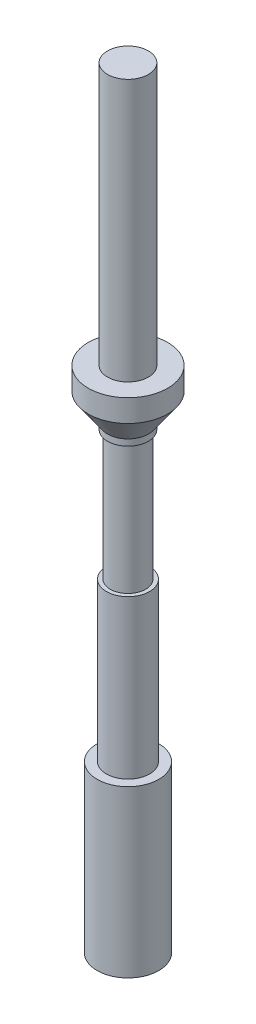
ISO-10303-21;
HEADER;
FILE_DESCRIPTION(('STEP AP214'),'2;1');
FILE_NAME('part.step','',(''),(''),'','','');
FILE_SCHEMA(('AUTOMOTIVE_DESIGN { 1 0 10303 214 1 1 1 1 }'));
ENDSEC;
DATA;
#1=APPLICATION_CONTEXT('core data for automotive mechanical design processes');
#2=APPLICATION_PROTOCOL_DEFINITION('international standard','automotive_design',2000,#1);
#3=PRODUCT_CONTEXT('',#1,'mechanical');
#4=PRODUCT('Part','Part','',(#3));
#5=PRODUCT_RELATED_PRODUCT_CATEGORY('part','',(#4));
#6=PRODUCT_DEFINITION_FORMATION('','',#4);
#7=PRODUCT_DEFINITION_CONTEXT('part definition',#1,'design');
#8=PRODUCT_DEFINITION('design','',#6,#7);
#9=PRODUCT_DEFINITION_SHAPE('','',#8);
#10=(LENGTH_UNIT() NAMED_UNIT(*) SI_UNIT(.MILLI.,.METRE.));
#11=(NAMED_UNIT(*) PLANE_ANGLE_UNIT() SI_UNIT($,.RADIAN.));
#12=(NAMED_UNIT(*) SI_UNIT($,.STERADIAN.) SOLID_ANGLE_UNIT());
#13=UNCERTAINTY_MEASURE_WITH_UNIT(LENGTH_MEASURE(1.E-05),#10,'distance_accuracy_value','');
#14=(GEOMETRIC_REPRESENTATION_CONTEXT(3) GLOBAL_UNCERTAINTY_ASSIGNED_CONTEXT((#13)) GLOBAL_UNIT_ASSIGNED_CONTEXT((#10,
#11,#12)) REPRESENTATION_CONTEXT('',''));
#15=CARTESIAN_POINT('',(0.,0.,0.));
#16=DIRECTION('',(0.,0.,1.));
#17=DIRECTION('',(1.,0.,0.));
#18=AXIS2_PLACEMENT_3D('',#15,#16,#17);
#19=CARTESIAN_POINT('',(0.,0.,0.));
#20=DIRECTION('',(0.,-1.,0.));
#21=DIRECTION('',(1.,0.,0.));
#22=AXIS2_PLACEMENT_3D('',#19,#20,#21);
#23=PLANE('',#22);
#24=CARTESIAN_POINT('',(0.,0.,0.));
#25=DIRECTION('',(0.,1.,0.));
#26=DIRECTION('',(-1.,0.,0.));
#27=AXIS2_PLACEMENT_3D('',#24,#25,#26);
#28=CIRCLE('',#27,2.65);
#29=CARTESIAN_POINT('',(-2.65,0.,0.));
#30=VERTEX_POINT('',#29);
#31=EDGE_CURVE('E10',#30,#30,#28,.T.);
#32=ORIENTED_EDGE('',*,*,#31,.T.);
#33=EDGE_LOOP('',(#32));
#34=FACE_BOUND('',#33,.T.);
#35=ADVANCED_FACE('F32',(#34),#23,.F.);
#36=CARTESIAN_POINT('',(0.,0.,0.));
#37=DIRECTION('',(0.,1.,0.));
#38=DIRECTION('',(-1.,0.,0.));
#39=AXIS2_PLACEMENT_3D('',#36,#37,#38);
#40=CYLINDRICAL_SURFACE('',#39,2.65);
#41=ORIENTED_EDGE('',*,*,#31,.F.);
#42=EDGE_LOOP('',(#41));
#43=FACE_BOUND('',#42,.T.);
#44=CARTESIAN_POINT('',(0.,-34.,0.));
#45=DIRECTION('',(0.,1.,0.));
#46=DIRECTION('',(-1.,0.,0.));
#47=AXIS2_PLACEMENT_3D('',#44,#45,#46);
#48=CIRCLE('',#47,2.65);
#49=CARTESIAN_POINT('',(-2.65,-34.,0.));
#50=VERTEX_POINT('',#49);
#51=EDGE_CURVE('E38',#50,#50,#48,.T.);
#52=ORIENTED_EDGE('',*,*,#51,.T.);
#53=EDGE_LOOP('',(#52));
#54=FACE_BOUND('',#53,.T.);
#55=ADVANCED_FACE('F88',(#43,#54),#40,.T.);
#56=CARTESIAN_POINT('',(2.65,-34.,0.));
#57=DIRECTION('',(0.,-1.,0.));
#58=DIRECTION('',(1.,0.,0.));
#59=AXIS2_PLACEMENT_3D('',#56,#57,#58);
#60=PLANE('',#59);
#61=ORIENTED_EDGE('',*,*,#51,.F.);
#62=EDGE_LOOP('',(#61));
#63=FACE_BOUND('',#62,.T.);
#64=CARTESIAN_POINT('',(0.,-34.,0.));
#65=DIRECTION('',(0.,1.,0.));
#66=DIRECTION('',(-1.,0.,0.));
#67=AXIS2_PLACEMENT_3D('',#64,#65,#66);
#68=CIRCLE('',#67,5.15);
#69=CARTESIAN_POINT('',(-5.15,-34.,0.));
#70=VERTEX_POINT('',#69);
#71=EDGE_CURVE('E42',#70,#70,#68,.T.);
#72=ORIENTED_EDGE('',*,*,#71,.T.);
#73=EDGE_LOOP('',(#72));
#74=FACE_BOUND('',#73,.T.);
#75=ADVANCED_FACE('F92',(#63,#74),#60,.F.);
#76=CARTESIAN_POINT('',(0.,0.,0.));
#77=DIRECTION('',(0.,1.,0.));
#78=DIRECTION('',(-1.,0.,0.));
#79=AXIS2_PLACEMENT_3D('',#76,#77,#78);
#80=CYLINDRICAL_SURFACE('',#79,5.15);
#81=ORIENTED_EDGE('',*,*,#71,.F.);
#82=EDGE_LOOP('',(#81));
#83=FACE_BOUND('',#82,.T.);
#84=CARTESIAN_POINT('',(0.,-36.9,0.));
#85=DIRECTION('',(0.,1.,0.));
#86=DIRECTION('',(-1.,0.,0.));
#87=AXIS2_PLACEMENT_3D('',#84,#85,#86);
#88=CIRCLE('',#87,5.15);
#89=CARTESIAN_POINT('',(-5.15,-36.9,0.));
#90=VERTEX_POINT('',#89);
#91=EDGE_CURVE('E46',#90,#90,#88,.T.);
#92=ORIENTED_EDGE('',*,*,#91,.T.);
#93=EDGE_LOOP('',(#92));
#94=FACE_BOUND('',#93,.T.);
#95=ADVANCED_FACE('F97',(#83,#94),#80,.T.);
#96=CARTESIAN_POINT('',(0.,-40.4,0.));
#97=DIRECTION('',(0.,1.,0.));
#98=DIRECTION('',(-1.,0.,0.));
#99=AXIS2_PLACEMENT_3D('',#96,#97,#98);
#100=CONICAL_SURFACE('',#99,2.65,0.620249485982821);
#101=ORIENTED_EDGE('',*,*,#91,.F.);
#102=EDGE_LOOP('',(#101));
#103=FACE_BOUND('',#102,.T.);
#104=CARTESIAN_POINT('',(0.,-40.4,0.));
#105=DIRECTION('',(0.,1.,0.));
#106=DIRECTION('',(-1.,0.,0.));
#107=AXIS2_PLACEMENT_3D('',#104,#105,#106);
#108=CIRCLE('',#107,2.65);
#109=CARTESIAN_POINT('',(-2.65,-40.4,0.));
#110=VERTEX_POINT('',#109);
#111=EDGE_CURVE('E51',#110,#110,#108,.T.);
#112=ORIENTED_EDGE('',*,*,#111,.T.);
#113=EDGE_LOOP('',(#112));
#114=FACE_BOUND('',#113,.T.);
#115=ADVANCED_FACE('F103',(#103,#114),#100,.T.);
#116=CARTESIAN_POINT('',(0.,0.,0.));
#117=DIRECTION('',(0.,1.,0.));
#118=DIRECTION('',(-1.,0.,0.));
#119=AXIS2_PLACEMENT_3D('',#116,#117,#118);
#120=CYLINDRICAL_SURFACE('',#119,2.65);
#121=ORIENTED_EDGE('',*,*,#111,.F.);
#122=EDGE_LOOP('',(#121));
#123=FACE_BOUND('',#122,.T.);
#124=CARTESIAN_POINT('',(0.,-41.210283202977,0.));
#125=DIRECTION('',(0.,1.,0.));
#126=DIRECTION('',(-1.,0.,0.));
#127=AXIS2_PLACEMENT_3D('',#124,#125,#126);
#128=CIRCLE('',#127,2.65);
#129=CARTESIAN_POINT('',(-2.65,-41.210283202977,0.));
#130=VERTEX_POINT('',#129);
#131=EDGE_CURVE('E54',#130,#130,#128,.T.);
#132=ORIENTED_EDGE('',*,*,#131,.T.);
#133=EDGE_LOOP('',(#132));
#134=FACE_BOUND('',#133,.T.);
#135=ADVANCED_FACE('F107',(#123,#134),#120,.T.);
#136=CARTESIAN_POINT('',(2.65000000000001,-41.210283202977,0.));
#137=DIRECTION('',(0.,1.,0.));
#138=DIRECTION('',(-1.,0.,0.));
#139=AXIS2_PLACEMENT_3D('',#136,#137,#138);
#140=PLANE('',#139);
#141=ORIENTED_EDGE('',*,*,#131,.F.);
#142=EDGE_LOOP('',(#141));
#143=FACE_BOUND('',#142,.T.);
#144=CARTESIAN_POINT('',(0.,-41.210283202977,0.));
#145=DIRECTION('',(0.,1.,0.));
#146=DIRECTION('',(-1.,0.,0.));
#147=AXIS2_PLACEMENT_3D('',#144,#145,#146);
#148=CIRCLE('',#147,2.3);
#149=CARTESIAN_POINT('',(-2.3,-41.210283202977,0.));
#150=VERTEX_POINT('',#149);
#151=EDGE_CURVE('E57',#150,#150,#148,.T.);
#152=ORIENTED_EDGE('',*,*,#151,.T.);
#153=EDGE_LOOP('',(#152));
#154=FACE_BOUND('',#153,.T.);
#155=ADVANCED_FACE('F111',(#143,#154),#140,.F.);
#156=CARTESIAN_POINT('',(0.,0.,0.));
#157=DIRECTION('',(0.,1.,0.));
#158=DIRECTION('',(-1.,0.,0.));
#159=AXIS2_PLACEMENT_3D('',#156,#157,#158);
#160=CYLINDRICAL_SURFACE('',#159,2.3);
#161=ORIENTED_EDGE('',*,*,#151,.F.);
#162=EDGE_LOOP('',(#161));
#163=FACE_BOUND('',#162,.T.);
#164=CARTESIAN_POINT('',(0.,-58.010283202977,0.));
#165=DIRECTION('',(0.,1.,0.));
#166=DIRECTION('',(-1.,0.,0.));
#167=AXIS2_PLACEMENT_3D('',#164,#165,#166);
#168=CIRCLE('',#167,2.3);
#169=CARTESIAN_POINT('',(-2.29999999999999,-58.010283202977,0.));
#170=VERTEX_POINT('',#169);
#171=EDGE_CURVE('E60',#170,#170,#168,.T.);
#172=ORIENTED_EDGE('',*,*,#171,.T.);
#173=EDGE_LOOP('',(#172));
#174=FACE_BOUND('',#173,.T.);
#175=ADVANCED_FACE('F115',(#163,#174),#160,.T.);
#176=CARTESIAN_POINT('',(2.30000000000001,-58.010283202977,0.));
#177=DIRECTION('',(0.,-1.,0.));
#178=DIRECTION('',(1.,0.,0.));
#179=AXIS2_PLACEMENT_3D('',#176,#177,#178);
#180=PLANE('',#179);
#181=ORIENTED_EDGE('',*,*,#171,.F.);
#182=EDGE_LOOP('',(#181));
#183=FACE_BOUND('',#182,.T.);
#184=CARTESIAN_POINT('',(0.,-58.010283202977,0.));
#185=DIRECTION('',(0.,1.,0.));
#186=DIRECTION('',(-1.,0.,0.));
#187=AXIS2_PLACEMENT_3D('',#184,#185,#186);
#188=CIRCLE('',#187,2.8);
#189=CARTESIAN_POINT('',(-2.79999999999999,-58.010283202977,0.));
#190=VERTEX_POINT('',#189);
#191=EDGE_CURVE('E63',#190,#190,#188,.T.);
#192=ORIENTED_EDGE('',*,*,#191,.T.);
#193=EDGE_LOOP('',(#192));
#194=FACE_BOUND('',#193,.T.);
#195=ADVANCED_FACE('F119',(#183,#194),#180,.F.);
#196=CARTESIAN_POINT('',(0.,0.,0.));
#197=DIRECTION('',(0.,1.,0.));
#198=DIRECTION('',(-1.,0.,0.));
#199=AXIS2_PLACEMENT_3D('',#196,#197,#198);
#200=CYLINDRICAL_SURFACE('',#199,2.8);
#201=ORIENTED_EDGE('',*,*,#191,.F.);
#202=EDGE_LOOP('',(#201));
#203=FACE_BOUND('',#202,.T.);
#204=CARTESIAN_POINT('',(0.,-78.510283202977,0.));
#205=DIRECTION('',(0.,1.,0.));
#206=DIRECTION('',(-1.,0.,0.));
#207=AXIS2_PLACEMENT_3D('',#204,#205,#206);
#208=CIRCLE('',#207,2.8);
#209=CARTESIAN_POINT('',(-2.79999999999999,-78.510283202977,0.));
#210=VERTEX_POINT('',#209);
#211=EDGE_CURVE('E66',#210,#210,#208,.T.);
#212=ORIENTED_EDGE('',*,*,#211,.T.);
#213=EDGE_LOOP('',(#212));
#214=FACE_BOUND('',#213,.T.);
#215=ADVANCED_FACE('F123',(#203,#214),#200,.T.);
#216=CARTESIAN_POINT('',(2.80000000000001,-78.510283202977,0.));
#217=DIRECTION('',(0.,-1.,0.));
#218=DIRECTION('',(1.,0.,0.));
#219=AXIS2_PLACEMENT_3D('',#216,#217,#218);
#220=PLANE('',#219);
#221=ORIENTED_EDGE('',*,*,#211,.F.);
#222=EDGE_LOOP('',(#221));
#223=FACE_BOUND('',#222,.T.);
#224=CARTESIAN_POINT('',(0.,-78.510283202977,0.));
#225=DIRECTION('',(0.,1.,0.));
#226=DIRECTION('',(-1.,0.,0.));
#227=AXIS2_PLACEMENT_3D('',#224,#225,#226);
#228=CIRCLE('',#227,4.);
#229=CARTESIAN_POINT('',(-3.99999999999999,-78.510283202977,0.));
#230=VERTEX_POINT('',#229);
#231=EDGE_CURVE('E69',#230,#230,#228,.T.);
#232=ORIENTED_EDGE('',*,*,#231,.T.);
#233=EDGE_LOOP('',(#232));
#234=FACE_BOUND('',#233,.T.);
#235=ADVANCED_FACE('F84',(#223,#234),#220,.F.);
#236=CARTESIAN_POINT('',(0.,0.,0.));
#237=DIRECTION('',(0.,1.,0.));
#238=DIRECTION('',(-1.,0.,0.));
#239=AXIS2_PLACEMENT_3D('',#236,#237,#238);
#240=CYLINDRICAL_SURFACE('',#239,4.);
#241=ORIENTED_EDGE('',*,*,#231,.F.);
#242=EDGE_LOOP('',(#241));
#243=FACE_BOUND('',#242,.T.);
#244=CARTESIAN_POINT('',(0.,-100.,0.));
#245=DIRECTION('',(0.,1.,0.));
#246=DIRECTION('',(-1.,0.,0.));
#247=AXIS2_PLACEMENT_3D('',#244,#245,#246);
#248=CIRCLE('',#247,4.);
#249=CARTESIAN_POINT('',(-3.99999999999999,-100.,0.));
#250=VERTEX_POINT('',#249);
#251=EDGE_CURVE('E72',#250,#250,#248,.T.);
#252=ORIENTED_EDGE('',*,*,#251,.T.);
#253=EDGE_LOOP('',(#252));
#254=FACE_BOUND('',#253,.T.);
#255=ADVANCED_FACE('F76',(#243,#254),#240,.T.);
#256=CARTESIAN_POINT('',(4.00000000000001,-100.,0.));
#257=DIRECTION('',(0.,1.,0.));
#258=DIRECTION('',(-1.,0.,0.));
#259=AXIS2_PLACEMENT_3D('',#256,#257,#258);
#260=PLANE('',#259);
#261=ORIENTED_EDGE('',*,*,#251,.F.);
#262=EDGE_LOOP('',(#261));
#263=FACE_BOUND('',#262,.T.);
#264=ADVANCED_FACE('F78',(#263),#260,.F.);
#265=CLOSED_SHELL('',(#35,#55,#75,#95,#115,#135,#155,#175,#195,#215,#235,#255,#264));
#266=MANIFOLD_SOLID_BREP('B2',#265);
#267=ADVANCED_BREP_SHAPE_REPRESENTATION('',(#18,#266),#14);
#268=SHAPE_DEFINITION_REPRESENTATION(#9,#267);
ENDSEC;
END-ISO-10303-21;
